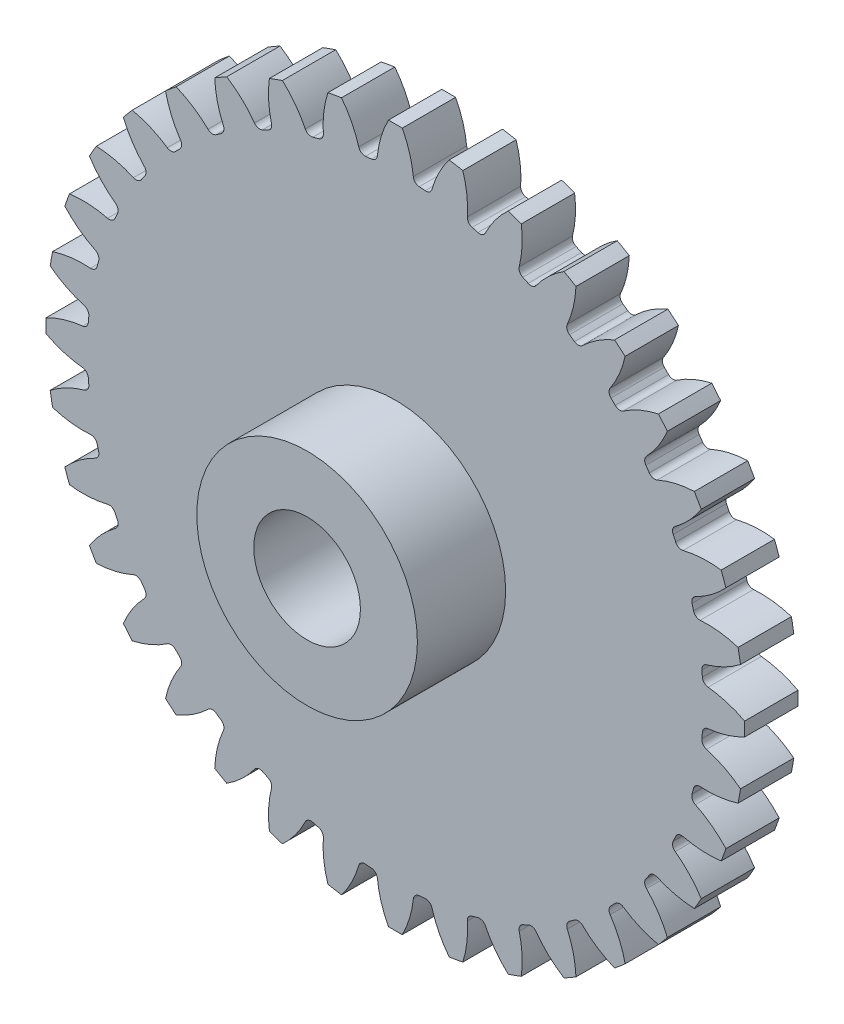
from build123d import *

# Parameters (mm, degrees)
BOSS_EXTRU_1_DEPTH                 = 1.45
CONG_1_R                           = 0.175
R_P_TITION_CIRCULAIRE4_COUNT       = 36
CONG_1_OF_R_P_TITION_CIRCULAIRE4_R = 0.175
ESQUISSE10_R                       = 1.45
ENL_V_MAT_EXTRU_4_DEPTH            = 15.888232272
ESQUISSE12_R                       = 3
ESQUISSE12_R_2                     = 1.45
EXTRUSION2_DEPTH                   = 2.4
EXTRUSION1_START                   = 0.5
ESQUISSE11_R                       = 2.2
ESQUISSE11_R_2                     = 1.45
EXTRUSION1_DEPTH                   = 0.5


with BuildPart() as part:
    # Esquisse3 → Boss.-Extru.1 (new body)
    with BuildSketch(Plane.XY):
        with BuildLine():
            Line((-2.108636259, 7.782778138), (-1.378706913, -0.560352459))
            Line((-1.378706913, -0.560352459), (-0.648777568, 7.782778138))
            ThreePointArc((-0.648777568, 7.782778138), (-0.76345333, 7.792017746), (-0.878245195, 7.799681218))
            ThreePointArc((-0.878245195, 7.799681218), (-0.97321156, 8.385519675), (-1.190535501, 8.937783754))
            ThreePointArc((-1.190535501, 8.937783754), (-1.378706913, 8.939647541), (-1.566878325, 8.937783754))
            ThreePointArc((-1.566878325, 8.937783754), (-1.784202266, 8.385519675), (-1.879168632, 7.799681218))
            ThreePointArc((-1.879168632, 7.799681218), (-1.993960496, 7.792017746), (-2.108636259, 7.782778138))
        make_face()
    boss_extru_1 = extrude(amount=BOSS_EXTRU_1_DEPTH)

    # Cong_1
    cong_1_edges = [part.edges().sort_by_distance(p)[0] for p in [
        (-1.879168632, 7.799681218, 0.725),
        (-0.878245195, 7.799681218, 0.725),
    ]]
    fillet(cong_1_edges, radius=CONG_1_R)

    # R_p_tition circulaire4: Boss.-Extru.1 ×36 about axis
    r_p_tition_circulaire4_axis = Axis((-1.378706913, -0.560352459, 0), (0, 0, 1))
    for i in range(1, R_P_TITION_CIRCULAIRE4_COUNT):
        add(boss_extru_1.rotate(r_p_tition_circulaire4_axis, i * 360 / R_P_TITION_CIRCULAIRE4_COUNT))

    # Cong_1 of R_p_tition circulaire4
    cong_1_of_r_p_tition_circulaire4_edges = [part.edges().sort_by_distance(p)[0] for p in [
        (-3.323270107, 7.585769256, 0.725),
        (-2.337552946, 7.759577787, 0.725),
        (-4.708287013, 7.124341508, 0.725),
        (-3.767726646, 7.466677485, 0.725),
        (-5.992136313, 6.429418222, 0.725),
        (-5.12531119, 6.929879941, 0.725),
        (-7.135808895, 5.522114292, 0.725),
        (-6.369057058, 6.165495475, 0.725),
        (-8.104554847, 4.429997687, 0.725),
        (-7.461173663, 5.196749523, 0.725),
        (-8.868939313, 3.186251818, 0.725),
        (-8.368477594, 4.053076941, 0.725),
        (-9.405736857, 1.828667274, 0.725),
        (-9.06340088, 2.769227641, 0.725),
        (-9.698637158, 0.398493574, 0.725),
        (-9.524828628, 1.384210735, 0.725),
        (-9.738740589, -1.060814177, 0.725),
        (-9.738740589, -0.05989074, 0.725),
        (-9.524828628, -2.504915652, 0.725),
        (-9.698637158, -1.519198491, 0.725),
        (-9.06340088, -3.889932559, 0.725),
        (-9.405736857, -2.949372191, 0.725),
        (-8.368477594, -5.173781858, 0.725),
        (-8.868939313, -4.306956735, 0.725),
        (-7.461173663, -6.317454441, 0.725),
        (-8.104554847, -5.550702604, 0.725),
        (-6.369057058, -7.286200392, 0.725),
        (-7.135808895, -6.642819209, 0.725),
        (-5.12531119, -8.050584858, 0.725),
        (-5.992136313, -7.55012314, 0.725),
        (-3.767726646, -8.587382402, 0.725),
        (-4.708287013, -8.245046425, 0.725),
        (-2.337552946, -8.880282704, 0.725),
        (-3.323270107, -8.706474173, 0.725),
        (-0.878245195, -8.920386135, 0.725),
        (-1.879168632, -8.920386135, 0.725),
        (0.56585628, -8.706474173, 0.725),
        (-0.41986088, -8.880282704, 0.725),
        (1.950873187, -8.245046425, 0.725),
        (1.010312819, -8.587382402, 0.725),
        (3.234722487, -7.55012314, 0.725),
        (2.367897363, -8.050584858, 0.725),
        (4.378395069, -6.642819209, 0.725),
        (3.611643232, -7.286200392, 0.725),
        (5.347141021, -5.550702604, 0.725),
        (4.703759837, -6.317454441, 0.725),
        (6.111525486, -4.306956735, 0.725),
        (5.611063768, -5.173781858, 0.725),
        (6.648323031, -2.949372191, 0.725),
        (6.305987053, -3.889932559, 0.725),
        (6.941223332, -1.519198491, 0.725),
        (6.767414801, -2.504915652, 0.725),
        (6.981326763, -0.05989074, 0.725),
        (6.981326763, -1.060814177, 0.725),
        (6.767414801, 1.384210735, 0.725),
        (6.941223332, 0.398493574, 0.725),
        (6.305987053, 2.769227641, 0.725),
        (6.648323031, 1.828667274, 0.725),
        (5.611063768, 4.053076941, 0.725),
        (6.111525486, 3.186251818, 0.725),
        (4.703759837, 5.196749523, 0.725),
        (5.347141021, 4.429997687, 0.725),
        (3.611643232, 6.165495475, 0.725),
        (4.378395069, 5.522114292, 0.725),
        (2.367897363, 6.929879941, 0.725),
        (3.234722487, 6.429418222, 0.725),
        (1.010312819, 7.466677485, 0.725),
        (1.950873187, 7.124341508, 0.725),
        (-0.41986088, 7.759577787, 0.725),
        (0.56585628, 7.585769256, 0.725),
    ]]
    fillet(cong_1_of_r_p_tition_circulaire4_edges, radius=CONG_1_OF_R_P_TITION_CIRCULAIRE4_R)

    # Esquisse10 → Enl_v. mat.-Extru.4 (cut, through all)
    with BuildSketch(Plane.XY):
        with Locations((-1.378706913, -0.560352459)):
            Circle(ESQUISSE10_R)
    extrude(amount=ENL_V_MAT_EXTRU_4_DEPTH, mode=Mode.SUBTRACT)

    # Esquisse12 → Extrusion2 (add)
    with BuildSketch(Plane.XY.offset(1.45)):
        with Locations((-1.378706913, -0.560352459)):
            Circle(ESQUISSE12_R)
        with Locations((-1.378706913, -0.560352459)):
            Circle(ESQUISSE12_R_2, mode=Mode.SUBTRACT)
    extrude(amount=EXTRUSION2_DEPTH)

    # Esquisse11 → Extrusion1 (add)
    with BuildSketch(Plane(origin=(0, 0, 0), x_dir=(-1, 0, 0), z_dir=(0, 0, -1)).offset(EXTRUSION1_START)):
        with Locations(Location((1.378706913, -0.560352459, 0), (0, 0, 180))):
            Circle(ESQUISSE11_R)
        with Locations((1.378706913, -0.560352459)):
            Circle(ESQUISSE11_R_2, mode=Mode.SUBTRACT)
    extrude(amount=-EXTRUSION1_DEPTH)


solid = part.part
